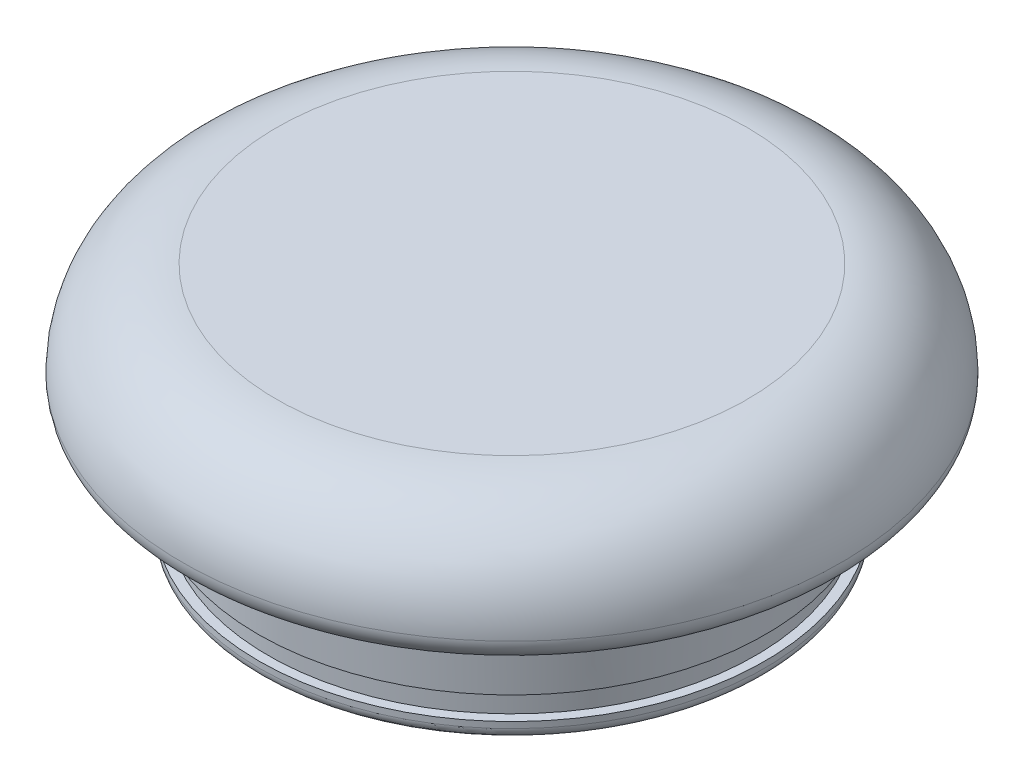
from build123d import *

# Parameters (mm, degrees)
FILLET2_R = 0.635


with BuildPart() as part:
    # Sketch1 → Base-Revolve (revolve)
    with BuildSketch(Plane.XY, mode=Mode.PRIVATE) as base_revolve_sk:
        with BuildLine():
            Line((-23.876, -25.4), (-23.104320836, -3.302))
            Line((-23.104320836, -3.302), (0, -3.302))
            Line((0, -3.302), (0, 0))
            Line((0, 0), (-25.4, 0))
            ThreePointArc((-25.4, 0), (-32.584204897, -2.975795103), (-35.56, -10.16))
            ThreePointArc((-35.56, -10.16), (-34.816051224, -11.956051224), (-33.02, -12.7))
            Line((-33.02, -12.7), (-27.686, -12.7))
            Line((-27.686, -12.7), (-27.397729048, -20.955))
            Line((-27.397729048, -20.955), (-26.381109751, -20.955))
            Line((-26.381109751, -20.955), (-26.292410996, -23.495))
            Line((-26.292410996, -23.495), (-27.309030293, -23.495))
            Line((-27.309030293, -23.495), (-27.285307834, -24.174322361))
            ThreePointArc((-27.285307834, -24.174322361), (-26.898297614, -25.043561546), (-26.016081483, -25.4))
            Line((-26.016081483, -25.4), (-23.876, -25.4))
        make_face()
    revolve(base_revolve_sk.sketch.rotate(Axis((0, -14.747460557, 0), (0, 1, 0)), 270), axis=Axis((0, -14.747460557, 0), (0, 1, 0)))

    # Fillet2
    fillet2_edges = [part.edges().sort_by_distance(p)[0] for p in [
        (0, -12.7, 27.686),
        (0, -3.302, 23.104320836),
    ]]
    fillet(fillet2_edges, radius=FILLET2_R)


solid = part.part
